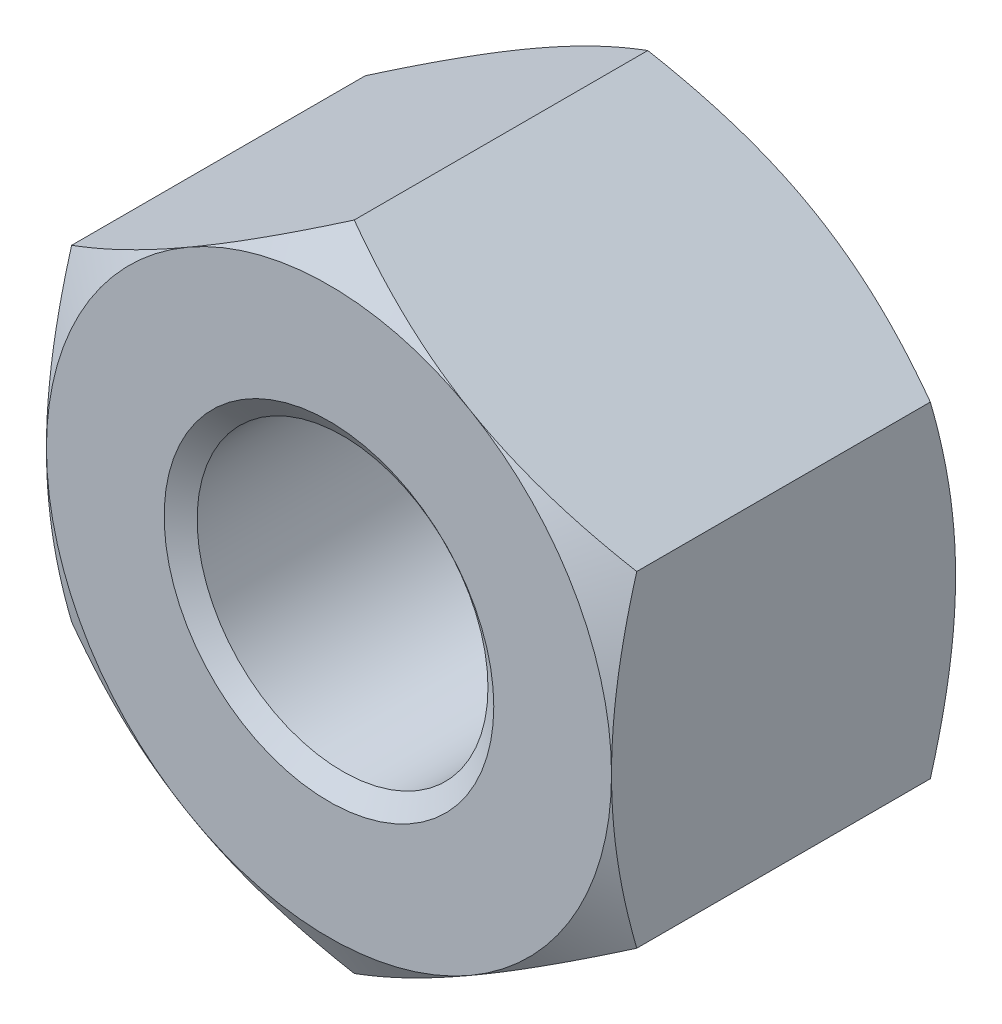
ISO-10303-21;
HEADER;
FILE_DESCRIPTION(('STEP AP214'),'2;1');
FILE_NAME('part.step','',(''),(''),'','','');
FILE_SCHEMA(('AUTOMOTIVE_DESIGN { 1 0 10303 214 1 1 1 1 }'));
ENDSEC;
DATA;
#1=APPLICATION_CONTEXT('core data for automotive mechanical design processes');
#2=APPLICATION_PROTOCOL_DEFINITION('international standard','automotive_design',2000,#1);
#3=PRODUCT_CONTEXT('',#1,'mechanical');
#4=PRODUCT('Part','Part','',(#3));
#5=PRODUCT_RELATED_PRODUCT_CATEGORY('part','',(#4));
#6=PRODUCT_DEFINITION_FORMATION('','',#4);
#7=PRODUCT_DEFINITION_CONTEXT('part definition',#1,'design');
#8=PRODUCT_DEFINITION('design','',#6,#7);
#9=PRODUCT_DEFINITION_SHAPE('','',#8);
#10=(LENGTH_UNIT() NAMED_UNIT(*) SI_UNIT(.MILLI.,.METRE.));
#11=(NAMED_UNIT(*) PLANE_ANGLE_UNIT() SI_UNIT($,.RADIAN.));
#12=(NAMED_UNIT(*) SI_UNIT($,.STERADIAN.) SOLID_ANGLE_UNIT());
#13=UNCERTAINTY_MEASURE_WITH_UNIT(LENGTH_MEASURE(1.E-05),#10,'distance_accuracy_value','');
#14=(GEOMETRIC_REPRESENTATION_CONTEXT(3) GLOBAL_UNCERTAINTY_ASSIGNED_CONTEXT((#13)) GLOBAL_UNIT_ASSIGNED_CONTEXT((#10,
#11,#12)) REPRESENTATION_CONTEXT('',''));
#15=CARTESIAN_POINT('',(0.,0.,0.));
#16=DIRECTION('',(0.,0.,1.));
#17=DIRECTION('',(1.,0.,0.));
#18=AXIS2_PLACEMENT_3D('',#15,#16,#17);
#19=CARTESIAN_POINT('',(0.,19.6299091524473,-20.7));
#20=DIRECTION('',(-0.500000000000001,0.866025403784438,0.));
#21=DIRECTION('',(-0.866025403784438,-0.500000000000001,0.));
#22=AXIS2_PLACEMENT_3D('',#19,#20,#21);
#23=PLANE('',#22);
#24=DIRECTION('',(0.,0.,1.));
#25=VECTOR('',#24,1.);
#26=CARTESIAN_POINT('',(-17.,9.81495457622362,-20.7));
#27=LINE('',#26,#25);
#28=CARTESIAN_POINT('',(-17.,9.81495457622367,-19.1816212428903));
#29=VERTEX_POINT('',#28);
#30=CARTESIAN_POINT('',(-17.,9.81495457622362,-1.51837875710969));
#31=VERTEX_POINT('',#30);
#32=EDGE_CURVE('E160',#29,#31,#27,.T.);
#33=ORIENTED_EDGE('',*,*,#32,.T.);
#34=CARTESIAN_POINT('',(-17.0002,9.81483910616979,-1.51844542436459));
#35=CARTESIAN_POINT('',(-16.6265469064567,10.0305678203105,-1.39390284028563));
#36=CARTESIAN_POINT('',(-16.251436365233,10.2471379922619,-1.27501178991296));
#37=CARTESIAN_POINT('',(-15.4982073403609,10.6820149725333,-1.05010368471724));
#38=CARTESIAN_POINT('',(-15.1200879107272,10.9003223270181,-0.944090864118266));
#39=CARTESIAN_POINT('',(-14.3601103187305,11.3390955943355,-0.746364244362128));
#40=CARTESIAN_POINT('',(-13.9782455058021,11.5595653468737,-0.654684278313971));
#41=CARTESIAN_POINT('',(-13.2118624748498,12.0020367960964,-0.487592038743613));
#42=CARTESIAN_POINT('',(-12.8273444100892,12.2240384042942,-0.412178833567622));
#43=CARTESIAN_POINT('',(-12.0655075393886,12.6638851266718,-0.280827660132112));
#44=CARTESIAN_POINT('',(-11.6882452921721,12.8816975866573,-0.224454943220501));
#45=CARTESIAN_POINT('',(-10.9319921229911,13.3183205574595,-0.129930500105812));
#46=CARTESIAN_POINT('',(-10.5530011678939,13.5371310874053,-0.0917791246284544));
#47=CARTESIAN_POINT('',(-9.79438261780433,13.9751197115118,-0.0346606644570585));
#48=CARTESIAN_POINT('',(-9.41475631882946,14.1942970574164,-0.0156707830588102));
#49=CARTESIAN_POINT('',(-8.65515330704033,14.6328540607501,0.00271629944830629));
#50=CARTESIAN_POINT('',(-8.27517660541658,14.8522337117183,0.00211410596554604));
#51=CARTESIAN_POINT('',(-7.56480067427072,15.2623694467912,-0.0173147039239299));
#52=CARTESIAN_POINT('',(-7.23435083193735,15.4531547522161,-0.0337721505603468));
#53=CARTESIAN_POINT('',(-6.57423939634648,15.8342702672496,-0.0811925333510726));
#54=CARTESIAN_POINT('',(-6.2445777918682,16.0246004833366,-0.112155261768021));
#55=CARTESIAN_POINT('',(-5.58616773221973,16.4047337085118,-0.188048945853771));
#56=CARTESIAN_POINT('',(-5.25742037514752,16.5945360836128,-0.232992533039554));
#57=CARTESIAN_POINT('',(-4.60149064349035,16.9732372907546,-0.336054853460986));
#58=CARTESIAN_POINT('',(-4.27430826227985,17.1621361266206,-0.394173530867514));
#59=CARTESIAN_POINT('',(-3.28110391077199,17.7355629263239,-0.589770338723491));
#60=CARTESIAN_POINT('',(-2.61795816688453,18.1184303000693,-0.74675203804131));
#61=CARTESIAN_POINT('',(-1.30155488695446,18.8784560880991,-1.1030361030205));
#62=CARTESIAN_POINT('',(-0.648280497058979,19.2556242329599,-1.30225479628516));
#63=CARTESIAN_POINT('',(0.000199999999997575,19.6300246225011,-1.51844542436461));
#64=B_SPLINE_CURVE_WITH_KNOTS('',3,(#34,#35,#36,#37,#38,#39,#40,#41,#42,#43,#44,#45,#46,#47,#48,
#49,#50,#51,#52,#53,#54,#55,#56,#57,#58,#59,#60,#61,#62,#63),.UNSPECIFIED.,.F.,.F.,(4,2,2,2,2,2,
2,2,2,2,2,2,2,2,4),(0.,1.34725361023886,2.6949489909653,4.04577911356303,5.3965318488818,
6.7139450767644,8.03138366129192,9.34725301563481,10.6630817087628,11.808581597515,
12.9540650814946,14.1005865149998,15.2471030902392,17.590639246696,19.929575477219),.UNSPECIFIED.);
#65=CARTESIAN_POINT('',(-8.50000000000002,14.7224318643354,0.));
#66=VERTEX_POINT('',#65);
#67=EDGE_CURVE('E56',#31,#66,#64,.T.);
#68=ORIENTED_EDGE('',*,*,#67,.T.);
#69=CARTESIAN_POINT('',(0.,19.6299091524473,-1.51837875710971));
#70=VERTEX_POINT('',#69);
#71=EDGE_CURVE('E204',#66,#70,#64,.T.);
#72=ORIENTED_EDGE('',*,*,#71,.T.);
#73=DIRECTION('',(0.,0.,1.));
#74=VECTOR('',#73,1.);
#75=CARTESIAN_POINT('',(0.,19.6299091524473,-20.7));
#76=LINE('',#75,#74);
#77=CARTESIAN_POINT('',(0.,19.6299091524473,-19.1816212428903));
#78=VERTEX_POINT('',#77);
#79=EDGE_CURVE('E145',#78,#70,#76,.T.);
#80=ORIENTED_EDGE('',*,*,#79,.F.);
#81=CARTESIAN_POINT('',(-17.0002,9.81483910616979,-19.1815545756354));
#82=CARTESIAN_POINT('',(-16.6265469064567,10.0305678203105,-19.3060971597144));
#83=CARTESIAN_POINT('',(-16.251436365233,10.2471379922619,-19.424988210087));
#84=CARTESIAN_POINT('',(-15.4982073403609,10.6820149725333,-19.6498963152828));
#85=CARTESIAN_POINT('',(-15.1200879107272,10.9003223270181,-19.7559091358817));
#86=CARTESIAN_POINT('',(-14.3601103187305,11.3390955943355,-19.9536357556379));
#87=CARTESIAN_POINT('',(-13.9782455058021,11.5595653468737,-20.045315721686));
#88=CARTESIAN_POINT('',(-13.2118624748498,12.0020367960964,-20.2124079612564));
#89=CARTESIAN_POINT('',(-12.8273444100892,12.2240384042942,-20.2878211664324));
#90=CARTESIAN_POINT('',(-12.0655075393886,12.6638851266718,-20.4191723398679));
#91=CARTESIAN_POINT('',(-11.6882452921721,12.8816975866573,-20.4755450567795));
#92=CARTESIAN_POINT('',(-10.9319921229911,13.3183205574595,-20.5700694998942));
#93=CARTESIAN_POINT('',(-10.5530011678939,13.5371310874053,-20.6082208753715));
#94=CARTESIAN_POINT('',(-9.79438261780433,13.9751197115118,-20.6653393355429));
#95=CARTESIAN_POINT('',(-9.41475631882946,14.1942970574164,-20.6843292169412));
#96=CARTESIAN_POINT('',(-8.65515330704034,14.6328540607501,-20.7027162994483));
#97=CARTESIAN_POINT('',(-8.27517660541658,14.8522337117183,-20.7021141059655));
#98=CARTESIAN_POINT('',(-7.56480067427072,15.2623694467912,-20.6826852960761));
#99=CARTESIAN_POINT('',(-7.23435083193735,15.4531547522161,-20.6662278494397));
#100=CARTESIAN_POINT('',(-6.57423939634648,15.8342702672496,-20.6188074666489));
#101=CARTESIAN_POINT('',(-6.2445777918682,16.0246004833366,-20.587844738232));
#102=CARTESIAN_POINT('',(-5.58616773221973,16.4047337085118,-20.5119510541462));
#103=CARTESIAN_POINT('',(-5.25742037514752,16.5945360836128,-20.4670074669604));
#104=CARTESIAN_POINT('',(-4.60149064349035,16.9732372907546,-20.363945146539));
#105=CARTESIAN_POINT('',(-4.27430826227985,17.1621361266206,-20.3058264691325));
#106=CARTESIAN_POINT('',(-3.28110391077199,17.7355629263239,-20.1102296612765));
#107=CARTESIAN_POINT('',(-2.61795816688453,18.1184303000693,-19.9532479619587));
#108=CARTESIAN_POINT('',(-1.30155488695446,18.8784560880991,-19.5969638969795));
#109=CARTESIAN_POINT('',(-0.648280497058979,19.2556242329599,-19.3977452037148));
#110=CARTESIAN_POINT('',(0.000199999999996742,19.6300246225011,-19.1815545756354));
#111=B_SPLINE_CURVE_WITH_KNOTS('',3,(#81,#82,#83,#84,#85,#86,#87,#88,#89,#90,#91,#92,#93,#94,
#95,#96,#97,#98,#99,#100,#101,#102,#103,#104,#105,#106,#107,#108,#109,#110),.UNSPECIFIED.,.F.,
.F.,(4,2,2,2,2,2,2,2,2,2,2,2,2,2,4),(0.,1.34725361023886,2.6949489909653,4.04577911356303,
5.3965318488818,6.7139450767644,8.03138366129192,9.3472530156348,10.6630817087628,
11.808581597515,12.9540650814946,14.1005865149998,15.2471030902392,17.590639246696,
19.929575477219),.UNSPECIFIED.);
#112=CARTESIAN_POINT('',(-8.50000000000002,14.7224318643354,-20.7));
#113=VERTEX_POINT('',#112);
#114=EDGE_CURVE('E163',#113,#78,#111,.T.);
#115=ORIENTED_EDGE('',*,*,#114,.F.);
#116=EDGE_CURVE('E210',#29,#113,#111,.T.);
#117=ORIENTED_EDGE('',*,*,#116,.F.);
#118=EDGE_LOOP('',(#33,#68,#72,#80,#115,#117));
#119=FACE_BOUND('',#118,.T.);
#120=ADVANCED_FACE('F33',(#119),#23,.T.);
#121=CARTESIAN_POINT('',(17.,9.81495457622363,-20.7));
#122=DIRECTION('',(0.500000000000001,0.866025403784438,0.));
#123=DIRECTION('',(-0.866025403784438,0.500000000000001,0.));
#124=AXIS2_PLACEMENT_3D('',#121,#122,#123);
#125=PLANE('',#124);
#126=ORIENTED_EDGE('',*,*,#79,.T.);
#127=CARTESIAN_POINT('',(-0.00020000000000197,19.6300246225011,-1.51844542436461));
#128=CARTESIAN_POINT('',(0.373453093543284,19.4142959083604,-1.39390284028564));
#129=CARTESIAN_POINT('',(0.748563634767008,19.197725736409,-1.27501178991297));
#130=CARTESIAN_POINT('',(1.50179265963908,18.7628487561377,-1.05010368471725));
#131=CARTESIAN_POINT('',(1.87991208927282,18.5445414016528,-0.944090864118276));
#132=CARTESIAN_POINT('',(2.63988968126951,18.1057681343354,-0.746364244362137));
#133=CARTESIAN_POINT('',(3.02175449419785,17.8852983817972,-0.654684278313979));
#134=CARTESIAN_POINT('',(3.78813752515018,17.4428269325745,-0.48759203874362));
#135=CARTESIAN_POINT('',(4.1726555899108,17.2208253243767,-0.412178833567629));
#136=CARTESIAN_POINT('',(4.93449246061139,16.7809786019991,-0.280827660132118));
#137=CARTESIAN_POINT('',(5.31175470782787,16.5631661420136,-0.224454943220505));
#138=CARTESIAN_POINT('',(6.06800787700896,16.1265431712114,-0.129930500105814));
#139=CARTESIAN_POINT('',(6.44699883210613,15.9077326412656,-0.0917791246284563));
#140=CARTESIAN_POINT('',(7.20561738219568,15.4697440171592,-0.0346606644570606));
#141=CARTESIAN_POINT('',(7.58524368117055,15.2505666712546,-0.0156707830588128));
#142=CARTESIAN_POINT('',(8.34484669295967,14.8120096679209,0.00271629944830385));
#143=CARTESIAN_POINT('',(8.72482339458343,14.5926300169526,0.00211410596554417));
#144=CARTESIAN_POINT('',(9.43519932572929,14.1824942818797,-0.0173147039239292));
#145=CARTESIAN_POINT('',(9.76564916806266,13.9917089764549,-0.0337721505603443));
#146=CARTESIAN_POINT('',(10.4257606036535,13.6105934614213,-0.08119253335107));
#147=CARTESIAN_POINT('',(10.7554222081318,13.4202632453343,-0.11215526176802));
#148=CARTESIAN_POINT('',(11.4138322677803,13.0401300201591,-0.18804894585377));
#149=CARTESIAN_POINT('',(11.7425796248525,12.8503276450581,-0.232992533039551));
#150=CARTESIAN_POINT('',(12.3985093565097,12.4716264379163,-0.33605485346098));
#151=CARTESIAN_POINT('',(12.7256917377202,12.2827276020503,-0.394173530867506));
#152=CARTESIAN_POINT('',(13.718896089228,11.709300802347,-0.589770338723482));
#153=CARTESIAN_POINT('',(14.3820418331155,11.3264334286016,-0.746752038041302));
#154=CARTESIAN_POINT('',(15.6984451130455,10.5664076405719,-1.10303610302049));
#155=CARTESIAN_POINT('',(16.351719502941,10.189239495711,-1.30225479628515));
#156=CARTESIAN_POINT('',(17.0002,9.81483910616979,-1.5184454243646));
#157=B_SPLINE_CURVE_WITH_KNOTS('',3,(#127,#128,#129,#130,#131,#132,#133,#134,#135,#136,#137,
#138,#139,#140,#141,#142,#143,#144,#145,#146,#147,#148,#149,#150,#151,#152,#153,#154,#155,#156),
.UNSPECIFIED.,.F.,.F.,(4,2,2,2,2,2,2,2,2,2,2,2,2,2,4),(0.,1.34725361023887,2.69494899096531,
4.04577911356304,5.39653184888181,6.71394507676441,8.03138366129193,9.34725301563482,
10.6630817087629,11.808581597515,12.9540650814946,14.1005865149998,15.2471030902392,
17.590639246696,19.9295754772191),.UNSPECIFIED.);
#158=CARTESIAN_POINT('',(8.50000000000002,14.7224318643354,0.));
#159=VERTEX_POINT('',#158);
#160=EDGE_CURVE('E138',#70,#159,#157,.T.);
#161=ORIENTED_EDGE('',*,*,#160,.T.);
#162=CARTESIAN_POINT('',(17.,9.81495457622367,-1.51837875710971));
#163=VERTEX_POINT('',#162);
#164=EDGE_CURVE('E124',#159,#163,#157,.T.);
#165=ORIENTED_EDGE('',*,*,#164,.T.);
#166=DIRECTION('',(0.,0.,1.));
#167=VECTOR('',#166,1.);
#168=CARTESIAN_POINT('',(17.,9.81495457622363,-20.7));
#169=LINE('',#168,#167);
#170=CARTESIAN_POINT('',(17.,9.81495457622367,-19.1816212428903));
#171=VERTEX_POINT('',#170);
#172=EDGE_CURVE('E137',#171,#163,#169,.T.);
#173=ORIENTED_EDGE('',*,*,#172,.F.);
#174=CARTESIAN_POINT('',(-0.00020000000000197,19.6300246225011,-19.1815545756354));
#175=CARTESIAN_POINT('',(0.373453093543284,19.4142959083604,-19.3060971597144));
#176=CARTESIAN_POINT('',(0.748563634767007,19.197725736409,-19.424988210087));
#177=CARTESIAN_POINT('',(1.50179265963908,18.7628487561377,-19.6498963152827));
#178=CARTESIAN_POINT('',(1.87991208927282,18.5445414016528,-19.7559091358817));
#179=CARTESIAN_POINT('',(2.63988968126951,18.1057681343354,-19.9536357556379));
#180=CARTESIAN_POINT('',(3.02175449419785,17.8852983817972,-20.045315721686));
#181=CARTESIAN_POINT('',(3.78813752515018,17.4428269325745,-20.2124079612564));
#182=CARTESIAN_POINT('',(4.1726555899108,17.2208253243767,-20.2878211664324));
#183=CARTESIAN_POINT('',(4.93449246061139,16.7809786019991,-20.4191723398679));
#184=CARTESIAN_POINT('',(5.31175470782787,16.5631661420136,-20.4755450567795));
#185=CARTESIAN_POINT('',(6.06800787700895,16.1265431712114,-20.5700694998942));
#186=CARTESIAN_POINT('',(6.44699883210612,15.9077326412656,-20.6082208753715));
#187=CARTESIAN_POINT('',(7.20561738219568,15.4697440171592,-20.6653393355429));
#188=CARTESIAN_POINT('',(7.58524368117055,15.2505666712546,-20.6843292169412));
#189=CARTESIAN_POINT('',(8.34484669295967,14.8120096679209,-20.7027162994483));
#190=CARTESIAN_POINT('',(8.72482339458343,14.5926300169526,-20.7021141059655));
#191=CARTESIAN_POINT('',(9.43519932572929,14.1824942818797,-20.6826852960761));
#192=CARTESIAN_POINT('',(9.76564916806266,13.9917089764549,-20.6662278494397));
#193=CARTESIAN_POINT('',(10.4257606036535,13.6105934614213,-20.6188074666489));
#194=CARTESIAN_POINT('',(10.7554222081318,13.4202632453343,-20.587844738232));
#195=CARTESIAN_POINT('',(11.4138322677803,13.0401300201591,-20.5119510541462));
#196=CARTESIAN_POINT('',(11.7425796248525,12.8503276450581,-20.4670074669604));
#197=CARTESIAN_POINT('',(12.3985093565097,12.4716264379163,-20.363945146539));
#198=CARTESIAN_POINT('',(12.7256917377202,12.2827276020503,-20.3058264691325));
#199=CARTESIAN_POINT('',(13.718896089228,11.709300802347,-20.1102296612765));
#200=CARTESIAN_POINT('',(14.3820418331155,11.3264334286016,-19.9532479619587));
#201=CARTESIAN_POINT('',(15.6984451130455,10.5664076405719,-19.5969638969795));
#202=CARTESIAN_POINT('',(16.351719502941,10.189239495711,-19.3977452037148));
#203=CARTESIAN_POINT('',(17.0002,9.81483910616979,-19.1815545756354));
#204=B_SPLINE_CURVE_WITH_KNOTS('',3,(#174,#175,#176,#177,#178,#179,#180,#181,#182,#183,#184,
#185,#186,#187,#188,#189,#190,#191,#192,#193,#194,#195,#196,#197,#198,#199,#200,#201,#202,#203),
.UNSPECIFIED.,.F.,.F.,(4,2,2,2,2,2,2,2,2,2,2,2,2,2,4),(0.,1.34725361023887,2.69494899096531,
4.04577911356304,5.39653184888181,6.71394507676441,8.03138366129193,9.34725301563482,
10.6630817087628,11.808581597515,12.9540650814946,14.1005865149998,15.2471030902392,
17.590639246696,19.9295754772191),.UNSPECIFIED.);
#205=CARTESIAN_POINT('',(8.50000000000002,14.7224318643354,-20.7));
#206=VERTEX_POINT('',#205);
#207=EDGE_CURVE('E221',#206,#171,#204,.T.);
#208=ORIENTED_EDGE('',*,*,#207,.F.);
#209=EDGE_CURVE('E222',#78,#206,#204,.T.);
#210=ORIENTED_EDGE('',*,*,#209,.F.);
#211=EDGE_LOOP('',(#126,#161,#165,#173,#208,#210));
#212=FACE_BOUND('',#211,.T.);
#213=ADVANCED_FACE('F135',(#212),#125,.T.);
#214=CARTESIAN_POINT('',(17.,9.81495457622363,-20.7));
#215=DIRECTION('',(-1.,0.,0.));
#216=DIRECTION('',(0.,0.,1.));
#217=AXIS2_PLACEMENT_3D('',#214,#215,#216);
#218=PLANE('',#217);
#219=CARTESIAN_POINT('',(17.,-26.0307059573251,-8.13495399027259));
#220=CARTESIAN_POINT('',(17.,-25.6575217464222,-7.95456227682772));
#221=CARTESIAN_POINT('',(17.,-25.2838864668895,-7.7751041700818));
#222=CARTESIAN_POINT('',(17.,-24.5356184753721,-7.41826946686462));
#223=CARTESIAN_POINT('',(17.,-24.1609857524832,-7.24089289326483));
#224=CARTESIAN_POINT('',(17.,-23.0353387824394,-6.71215553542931));
#225=CARTESIAN_POINT('',(17.,-22.2826970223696,-6.36424591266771));
#226=CARTESIAN_POINT('',(17.,-20.7679056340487,-5.6778850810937));
#227=CARTESIAN_POINT('',(17.,-20.0057262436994,-5.33949939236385));
#228=CARTESIAN_POINT('',(17.,-18.4751037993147,-4.67725670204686));
#229=CARTESIAN_POINT('',(17.,-17.7066610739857,-4.35339894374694));
#230=CARTESIAN_POINT('',(17.,-16.152750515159,-3.72023983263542));
#231=CARTESIAN_POINT('',(17.,-15.3671894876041,-3.41116600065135));
#232=CARTESIAN_POINT('',(17.,-13.7867962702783,-2.81722387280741));
#233=CARTESIAN_POINT('',(17.,-12.9919630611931,-2.53235826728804));
#234=CARTESIAN_POINT('',(17.,-11.3934196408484,-1.99449069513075));
#235=CARTESIAN_POINT('',(17.,-10.589732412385,-1.74142098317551));
#236=CARTESIAN_POINT('',(17.,-8.97085479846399,-1.27535153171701));
#237=CARTESIAN_POINT('',(17.,-8.15566813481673,-1.06233913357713));
#238=CARTESIAN_POINT('',(17.,-6.92410865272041,-0.780661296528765));
#239=CARTESIAN_POINT('',(17.,-6.51203814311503,-0.693061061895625));
#240=CARTESIAN_POINT('',(17.,-5.68515456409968,-0.531857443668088));
#241=CARTESIAN_POINT('',(17.,-5.27034155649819,-0.458253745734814));
#242=CARTESIAN_POINT('',(17.,-4.43825138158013,-0.326348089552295));
#243=CARTESIAN_POINT('',(17.,-4.02097406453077,-0.268047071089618));
#244=CARTESIAN_POINT('',(17.,-3.1844334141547,-0.167917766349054));
#245=CARTESIAN_POINT('',(17.,-2.76517007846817,-0.126089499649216));
#246=CARTESIAN_POINT('',(17.,-1.9279303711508,-0.0600317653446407));
#247=CARTESIAN_POINT('',(17.,-1.509962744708,-0.0356921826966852));
#248=CARTESIAN_POINT('',(17.,-0.673373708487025,-0.00473977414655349));
#249=CARTESIAN_POINT('',(17.,-0.254752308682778,0.00187331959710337));
#250=CARTESIAN_POINT('',(17.,0.582277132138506,-0.00278408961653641));
#251=CARTESIAN_POINT('',(17.,1.00068520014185,-0.0140496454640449));
#252=CARTESIAN_POINT('',(17.,1.83665802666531,-0.0541842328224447));
#253=CARTESIAN_POINT('',(17.,2.25422274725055,-0.083054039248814));
#254=CARTESIAN_POINT('',(17.,3.26596548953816,-0.173730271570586));
#255=CARTESIAN_POINT('',(17.,3.8593699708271,-0.244339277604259));
#256=CARTESIAN_POINT('',(17.,5.04153028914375,-0.417178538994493));
#257=CARTESIAN_POINT('',(17.,5.6302854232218,-0.51941348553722));
#258=CARTESIAN_POINT('',(17.,7.39060393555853,-0.868429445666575));
#259=CARTESIAN_POINT('',(17.,8.55392089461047,-1.15728923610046));
#260=CARTESIAN_POINT('',(17.,10.2940487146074,-1.65537919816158));
#261=CARTESIAN_POINT('',(17.,10.8799513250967,-1.83464660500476));
#262=CARTESIAN_POINT('',(17.,12.0460961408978,-2.2110551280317));
#263=CARTESIAN_POINT('',(17.,12.6263378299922,-2.40819785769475));
#264=CARTESIAN_POINT('',(17.,13.7782685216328,-2.81615640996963));
#265=CARTESIAN_POINT('',(17.,14.3499873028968,-3.026888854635));
#266=CARTESIAN_POINT('',(17.,15.2039647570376,-3.35211134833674));
#267=CARTESIAN_POINT('',(17.,15.4879778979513,-3.46202087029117));
#268=CARTESIAN_POINT('',(17.,16.0549008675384,-3.68463436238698));
#269=CARTESIAN_POINT('',(17.,16.3378107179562,-3.79733827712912));
#270=CARTESIAN_POINT('',(17.,16.6202072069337,-3.91131327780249));
#271=B_SPLINE_CURVE_WITH_KNOTS('',3,(#219,#220,#221,#222,#223,#224,#225,#226,#227,#228,#229,
#230,#231,#232,#233,#234,#235,#236,#237,#238,#239,#240,#241,#242,#243,#244,#245,#246,#247,#248,
#249,#250,#251,#252,#253,#254,#255,#256,#257,#258,#259,#260,#261,#262,#263,#264,#265,#266,#267,
#268,#269,#270),.UNSPECIFIED.,.F.,.F.,(4,2,2,2,2,2,2,2,2,2,2,2,2,2,2,2,2,2,2,2,2,2,2,2,2,4),(0.,
1.24348808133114,2.48698981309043,4.97439762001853,7.47603986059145,9.97755164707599,
12.5097743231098,15.0422780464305,17.5692909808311,20.0955039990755,21.359141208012,
22.6227500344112,23.8864364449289,25.1501243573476,26.4057842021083,27.6614250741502,
28.9167185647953,30.172067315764,31.9638212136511,33.7558410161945,37.3467834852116,
39.184781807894,41.0229461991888,42.8507444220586,43.7643464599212,44.6779303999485),.UNSPECIFIED.);
#272=CARTESIAN_POINT('',(17.,-9.81495457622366,-1.51837875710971));
#273=VERTEX_POINT('',#272);
#274=CARTESIAN_POINT('',(17.,0.,0.));
#275=VERTEX_POINT('',#274);
#276=EDGE_CURVE('E130',#273,#275,#271,.T.);
#277=ORIENTED_EDGE('',*,*,#276,.F.);
#278=DIRECTION('',(0.,0.,1.));
#279=VECTOR('',#278,1.);
#280=CARTESIAN_POINT('',(17.,-9.81495457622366,-20.7));
#281=LINE('',#280,#279);
#282=CARTESIAN_POINT('',(17.,-9.81495457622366,-19.1816212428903));
#283=VERTEX_POINT('',#282);
#284=EDGE_CURVE('E146',#283,#273,#281,.T.);
#285=ORIENTED_EDGE('',*,*,#284,.F.);
#286=CARTESIAN_POINT('',(17.,-26.0307059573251,-12.5650460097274));
#287=CARTESIAN_POINT('',(17.,-25.6575217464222,-12.7454377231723));
#288=CARTESIAN_POINT('',(17.,-25.2838864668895,-12.9248958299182));
#289=CARTESIAN_POINT('',(17.,-24.5356184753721,-13.2817305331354));
#290=CARTESIAN_POINT('',(17.,-24.1609857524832,-13.4591071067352));
#291=CARTESIAN_POINT('',(17.,-23.0353387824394,-13.9878444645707));
#292=CARTESIAN_POINT('',(17.,-22.2826970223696,-14.3357540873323));
#293=CARTESIAN_POINT('',(17.,-20.7679056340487,-15.0221149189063));
#294=CARTESIAN_POINT('',(17.,-20.0057262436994,-15.3605006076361));
#295=CARTESIAN_POINT('',(17.,-18.4751037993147,-16.0227432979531));
#296=CARTESIAN_POINT('',(17.,-17.7066610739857,-16.3466010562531));
#297=CARTESIAN_POINT('',(17.,-16.152750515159,-16.9797601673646));
#298=CARTESIAN_POINT('',(17.,-15.3671894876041,-17.2888339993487));
#299=CARTESIAN_POINT('',(17.,-13.7867962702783,-17.8827761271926));
#300=CARTESIAN_POINT('',(17.,-12.9919630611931,-18.167641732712));
#301=CARTESIAN_POINT('',(17.,-11.3934196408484,-18.7055093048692));
#302=CARTESIAN_POINT('',(17.,-10.589732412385,-18.9585790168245));
#303=CARTESIAN_POINT('',(17.,-8.97085479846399,-19.424648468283));
#304=CARTESIAN_POINT('',(17.,-8.15566813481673,-19.6376608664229));
#305=CARTESIAN_POINT('',(17.,-6.92410865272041,-19.9193387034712));
#306=CARTESIAN_POINT('',(17.,-6.51203814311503,-20.0069389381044));
#307=CARTESIAN_POINT('',(17.,-5.68515456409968,-20.1681425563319));
#308=CARTESIAN_POINT('',(17.,-5.27034155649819,-20.2417462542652));
#309=CARTESIAN_POINT('',(17.,-4.43825138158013,-20.3736519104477));
#310=CARTESIAN_POINT('',(17.,-4.02097406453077,-20.4319529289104));
#311=CARTESIAN_POINT('',(17.,-3.1844334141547,-20.5320822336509));
#312=CARTESIAN_POINT('',(17.,-2.76517007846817,-20.5739105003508));
#313=CARTESIAN_POINT('',(17.,-1.9279303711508,-20.6399682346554));
#314=CARTESIAN_POINT('',(17.,-1.509962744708,-20.6643078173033));
#315=CARTESIAN_POINT('',(17.,-0.673373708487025,-20.6952602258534));
#316=CARTESIAN_POINT('',(17.,-0.254752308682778,-20.7018733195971));
#317=CARTESIAN_POINT('',(17.,0.582277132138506,-20.6972159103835));
#318=CARTESIAN_POINT('',(17.,1.00068520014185,-20.685950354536));
#319=CARTESIAN_POINT('',(17.,1.83665802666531,-20.6458157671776));
#320=CARTESIAN_POINT('',(17.,2.25422274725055,-20.6169459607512));
#321=CARTESIAN_POINT('',(17.,3.26596548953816,-20.5262697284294));
#322=CARTESIAN_POINT('',(17.,3.85936997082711,-20.4556607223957));
#323=CARTESIAN_POINT('',(17.,5.04153028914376,-20.2828214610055));
#324=CARTESIAN_POINT('',(17.,5.63028542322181,-20.1805865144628));
#325=CARTESIAN_POINT('',(17.,7.39060393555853,-19.8315705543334));
#326=CARTESIAN_POINT('',(17.,8.55392089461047,-19.5427107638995));
#327=CARTESIAN_POINT('',(17.,10.2940487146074,-19.0446208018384));
#328=CARTESIAN_POINT('',(17.,10.8799513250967,-18.8653533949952));
#329=CARTESIAN_POINT('',(17.,12.0460961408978,-18.4889448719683));
#330=CARTESIAN_POINT('',(17.,12.6263378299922,-18.2918021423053));
#331=CARTESIAN_POINT('',(17.,13.7782685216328,-17.8838435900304));
#332=CARTESIAN_POINT('',(17.,14.3499873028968,-17.673111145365));
#333=CARTESIAN_POINT('',(17.,15.2039647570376,-17.3478886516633));
#334=CARTESIAN_POINT('',(17.,15.4879778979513,-17.2379791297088));
#335=CARTESIAN_POINT('',(17.,16.0549008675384,-17.015365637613));
#336=CARTESIAN_POINT('',(17.,16.3378107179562,-16.9026617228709));
#337=CARTESIAN_POINT('',(17.,16.6202072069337,-16.7886867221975));
#338=B_SPLINE_CURVE_WITH_KNOTS('',3,(#286,#287,#288,#289,#290,#291,#292,#293,#294,#295,#296,
#297,#298,#299,#300,#301,#302,#303,#304,#305,#306,#307,#308,#309,#310,#311,#312,#313,#314,#315,
#316,#317,#318,#319,#320,#321,#322,#323,#324,#325,#326,#327,#328,#329,#330,#331,#332,#333,#334,
#335,#336,#337),.UNSPECIFIED.,.F.,.F.,(4,2,2,2,2,2,2,2,2,2,2,2,2,2,2,2,2,2,2,2,2,2,2,2,2,4),(0.,
1.24348808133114,2.48698981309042,4.97439762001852,7.47603986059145,9.97755164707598,
12.5097743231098,15.0422780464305,17.5692909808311,20.0955039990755,21.359141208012,
22.6227500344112,23.8864364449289,25.1501243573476,26.4057842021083,27.6614250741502,
28.9167185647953,30.172067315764,31.9638212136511,33.7558410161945,37.3467834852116,
39.184781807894,41.0229461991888,42.8507444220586,43.7643464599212,44.6779303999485),.UNSPECIFIED.);
#339=CARTESIAN_POINT('',(17.,0.,-20.7));
#340=VERTEX_POINT('',#339);
#341=EDGE_CURVE('E207',#283,#340,#338,.T.);
#342=ORIENTED_EDGE('',*,*,#341,.T.);
#343=EDGE_CURVE('E144',#340,#171,#338,.T.);
#344=ORIENTED_EDGE('',*,*,#343,.T.);
#345=ORIENTED_EDGE('',*,*,#172,.T.);
#346=EDGE_CURVE('E121',#275,#163,#271,.T.);
#347=ORIENTED_EDGE('',*,*,#346,.F.);
#348=EDGE_LOOP('',(#277,#285,#342,#344,#345,#347));
#349=FACE_BOUND('',#348,.T.);
#350=ADVANCED_FACE('F141',(#349),#218,.F.);
#351=CARTESIAN_POINT('',(0.,-19.6299091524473,-20.7));
#352=DIRECTION('',(0.500000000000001,-0.866025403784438,0.));
#353=DIRECTION('',(0.866025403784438,0.500000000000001,0.));
#354=AXIS2_PLACEMENT_3D('',#351,#352,#353);
#355=PLANE('',#354);
#356=ORIENTED_EDGE('',*,*,#284,.T.);
#357=CARTESIAN_POINT('',(17.0002,-9.81483910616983,-1.51844542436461));
#358=CARTESIAN_POINT('',(16.6265469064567,-10.0305678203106,-1.39390284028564));
#359=CARTESIAN_POINT('',(16.251436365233,-10.247137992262,-1.27501178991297));
#360=CARTESIAN_POINT('',(15.4982073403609,-10.6820149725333,-1.05010368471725));
#361=CARTESIAN_POINT('',(15.1200879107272,-10.9003223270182,-0.94409086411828));
#362=CARTESIAN_POINT('',(14.3601103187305,-11.3390955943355,-0.746364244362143));
#363=CARTESIAN_POINT('',(13.9782455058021,-11.5595653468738,-0.654684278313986));
#364=CARTESIAN_POINT('',(13.2118624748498,-12.0020367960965,-0.487592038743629));
#365=CARTESIAN_POINT('',(12.8273444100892,-12.2240384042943,-0.412178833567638));
#366=CARTESIAN_POINT('',(12.0655075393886,-12.6638851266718,-0.280827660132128));
#367=CARTESIAN_POINT('',(11.6882452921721,-12.8816975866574,-0.224454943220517));
#368=CARTESIAN_POINT('',(10.931992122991,-13.3183205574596,-0.12993050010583));
#369=CARTESIAN_POINT('',(10.5530011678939,-13.5371310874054,-0.0917791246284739));
#370=CARTESIAN_POINT('',(9.79438261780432,-13.9751197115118,-0.0346606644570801));
#371=CARTESIAN_POINT('',(9.41475631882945,-14.1942970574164,-0.0156707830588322));
#372=CARTESIAN_POINT('',(8.65515330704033,-14.6328540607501,0.00271629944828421));
#373=CARTESIAN_POINT('',(8.27517660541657,-14.8522337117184,0.00211410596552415));
#374=CARTESIAN_POINT('',(7.56480067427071,-15.2623694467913,-0.017314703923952));
#375=CARTESIAN_POINT('',(7.23435083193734,-15.4531547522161,-0.0337721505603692));
#376=CARTESIAN_POINT('',(6.57423939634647,-15.8342702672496,-0.0811925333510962));
#377=CARTESIAN_POINT('',(6.24457779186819,-16.0246004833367,-0.112155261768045));
#378=CARTESIAN_POINT('',(5.58616773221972,-16.4047337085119,-0.188048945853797));
#379=CARTESIAN_POINT('',(5.25742037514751,-16.5945360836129,-0.232992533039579));
#380=CARTESIAN_POINT('',(4.60149064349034,-16.9732372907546,-0.33605485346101));
#381=CARTESIAN_POINT('',(4.27430826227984,-17.1621361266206,-0.394173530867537));
#382=CARTESIAN_POINT('',(3.28110391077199,-17.735562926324,-0.589770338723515));
#383=CARTESIAN_POINT('',(2.61795816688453,-18.1184303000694,-0.746752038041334));
#384=CARTESIAN_POINT('',(1.30155488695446,-18.8784560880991,-1.10303610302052));
#385=CARTESIAN_POINT('',(0.64828049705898,-19.2556242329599,-1.30225479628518));
#386=CARTESIAN_POINT('',(-0.000199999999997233,-19.6300246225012,-1.51844542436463));
#387=B_SPLINE_CURVE_WITH_KNOTS('',3,(#357,#358,#359,#360,#361,#362,#363,#364,#365,#366,#367,
#368,#369,#370,#371,#372,#373,#374,#375,#376,#377,#378,#379,#380,#381,#382,#383,#384,#385,#386),
.UNSPECIFIED.,.F.,.F.,(4,2,2,2,2,2,2,2,2,2,2,2,2,2,4),(0.,1.34725361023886,2.69494899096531,
4.04577911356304,5.39653184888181,6.71394507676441,8.03138366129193,9.34725301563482,
10.6630817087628,11.808581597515,12.9540650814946,14.1005865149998,15.2471030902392,
17.590639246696,19.9295754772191),.UNSPECIFIED.);
#388=CARTESIAN_POINT('',(8.50000000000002,-14.7224318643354,0.));
#389=VERTEX_POINT('',#388);
#390=EDGE_CURVE('E280',#273,#389,#387,.T.);
#391=ORIENTED_EDGE('',*,*,#390,.T.);
#392=CARTESIAN_POINT('',(0.,-19.6299091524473,-1.51837875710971));
#393=VERTEX_POINT('',#392);
#394=EDGE_CURVE('E274',#389,#393,#387,.T.);
#395=ORIENTED_EDGE('',*,*,#394,.T.);
#396=DIRECTION('',(0.,0.,1.));
#397=VECTOR('',#396,1.);
#398=CARTESIAN_POINT('',(0.,-19.6299091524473,-20.7));
#399=LINE('',#398,#397);
#400=CARTESIAN_POINT('',(0.,-19.6299091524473,-19.1816212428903));
#401=VERTEX_POINT('',#400);
#402=EDGE_CURVE('E151',#401,#393,#399,.T.);
#403=ORIENTED_EDGE('',*,*,#402,.F.);
#404=CARTESIAN_POINT('',(17.0002,-9.81483910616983,-19.1815545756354));
#405=CARTESIAN_POINT('',(16.6265469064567,-10.0305678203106,-19.3060971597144));
#406=CARTESIAN_POINT('',(16.251436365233,-10.247137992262,-19.424988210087));
#407=CARTESIAN_POINT('',(15.4982073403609,-10.6820149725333,-19.6498963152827));
#408=CARTESIAN_POINT('',(15.1200879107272,-10.9003223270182,-19.7559091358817));
#409=CARTESIAN_POINT('',(14.3601103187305,-11.3390955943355,-19.9536357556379));
#410=CARTESIAN_POINT('',(13.9782455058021,-11.5595653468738,-20.045315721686));
#411=CARTESIAN_POINT('',(13.2118624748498,-12.0020367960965,-20.2124079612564));
#412=CARTESIAN_POINT('',(12.8273444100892,-12.2240384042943,-20.2878211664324));
#413=CARTESIAN_POINT('',(12.0655075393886,-12.6638851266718,-20.4191723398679));
#414=CARTESIAN_POINT('',(11.6882452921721,-12.8816975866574,-20.4755450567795));
#415=CARTESIAN_POINT('',(10.931992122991,-13.3183205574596,-20.5700694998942));
#416=CARTESIAN_POINT('',(10.5530011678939,-13.5371310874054,-20.6082208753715));
#417=CARTESIAN_POINT('',(9.79438261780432,-13.9751197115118,-20.6653393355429));
#418=CARTESIAN_POINT('',(9.41475631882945,-14.1942970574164,-20.6843292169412));
#419=CARTESIAN_POINT('',(8.65515330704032,-14.6328540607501,-20.7027162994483));
#420=CARTESIAN_POINT('',(8.27517660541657,-14.8522337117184,-20.7021141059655));
#421=CARTESIAN_POINT('',(7.56480067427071,-15.2623694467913,-20.682685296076));
#422=CARTESIAN_POINT('',(7.23435083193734,-15.4531547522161,-20.6662278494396));
#423=CARTESIAN_POINT('',(6.57423939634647,-15.8342702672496,-20.6188074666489));
#424=CARTESIAN_POINT('',(6.24457779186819,-16.0246004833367,-20.587844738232));
#425=CARTESIAN_POINT('',(5.58616773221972,-16.4047337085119,-20.5119510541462));
#426=CARTESIAN_POINT('',(5.25742037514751,-16.5945360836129,-20.4670074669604));
#427=CARTESIAN_POINT('',(4.60149064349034,-16.9732372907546,-20.363945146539));
#428=CARTESIAN_POINT('',(4.27430826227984,-17.1621361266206,-20.3058264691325));
#429=CARTESIAN_POINT('',(3.28110391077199,-17.735562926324,-20.1102296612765));
#430=CARTESIAN_POINT('',(2.61795816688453,-18.1184303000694,-19.9532479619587));
#431=CARTESIAN_POINT('',(1.30155488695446,-18.8784560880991,-19.5969638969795));
#432=CARTESIAN_POINT('',(0.648280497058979,-19.2556242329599,-19.3977452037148));
#433=CARTESIAN_POINT('',(-0.000199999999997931,-19.6300246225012,-19.1815545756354));
#434=B_SPLINE_CURVE_WITH_KNOTS('',3,(#404,#405,#406,#407,#408,#409,#410,#411,#412,#413,#414,
#415,#416,#417,#418,#419,#420,#421,#422,#423,#424,#425,#426,#427,#428,#429,#430,#431,#432,#433),
.UNSPECIFIED.,.F.,.F.,(4,2,2,2,2,2,2,2,2,2,2,2,2,2,4),(0.,1.34725361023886,2.69494899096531,
4.04577911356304,5.39653184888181,6.71394507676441,8.03138366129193,9.34725301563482,
10.6630817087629,11.808581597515,12.9540650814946,14.1005865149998,15.2471030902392,
17.590639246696,19.9295754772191),.UNSPECIFIED.);
#435=CARTESIAN_POINT('',(8.50000000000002,-14.7224318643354,-20.7));
#436=VERTEX_POINT('',#435);
#437=EDGE_CURVE('E214',#436,#401,#434,.T.);
#438=ORIENTED_EDGE('',*,*,#437,.F.);
#439=EDGE_CURVE('E211',#283,#436,#434,.T.);
#440=ORIENTED_EDGE('',*,*,#439,.F.);
#441=EDGE_LOOP('',(#356,#391,#395,#403,#438,#440));
#442=FACE_BOUND('',#441,.T.);
#443=ADVANCED_FACE('F265',(#442),#355,.T.);
#444=CARTESIAN_POINT('',(-17.,-9.81495457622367,-20.7));
#445=DIRECTION('',(-0.500000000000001,-0.866025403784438,0.));
#446=DIRECTION('',(0.866025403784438,-0.500000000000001,0.));
#447=AXIS2_PLACEMENT_3D('',#444,#445,#446);
#448=PLANE('',#447);
#449=ORIENTED_EDGE('',*,*,#402,.T.);
#450=CARTESIAN_POINT('',(0.000200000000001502,-19.6300246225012,-1.51844542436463));
#451=CARTESIAN_POINT('',(-0.373453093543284,-19.4142959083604,-1.39390284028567));
#452=CARTESIAN_POINT('',(-0.748563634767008,-19.197725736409,-1.275011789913));
#453=CARTESIAN_POINT('',(-1.50179265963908,-18.7628487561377,-1.05010368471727));
#454=CARTESIAN_POINT('',(-1.87991208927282,-18.5445414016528,-0.944090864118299));
#455=CARTESIAN_POINT('',(-2.63988968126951,-18.1057681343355,-0.746364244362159));
#456=CARTESIAN_POINT('',(-3.02175449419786,-17.8852983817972,-0.654684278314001));
#457=CARTESIAN_POINT('',(-3.78813752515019,-17.4428269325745,-0.487592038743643));
#458=CARTESIAN_POINT('',(-4.17265558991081,-17.2208253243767,-0.412178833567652));
#459=CARTESIAN_POINT('',(-4.9344924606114,-16.7809786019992,-0.280827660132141));
#460=CARTESIAN_POINT('',(-5.31175470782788,-16.5631661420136,-0.224454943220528));
#461=CARTESIAN_POINT('',(-6.06800787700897,-16.1265431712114,-0.129930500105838));
#462=CARTESIAN_POINT('',(-6.44699883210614,-15.9077326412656,-0.0917791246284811));
#463=CARTESIAN_POINT('',(-7.20561738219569,-15.4697440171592,-0.034660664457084));
#464=CARTESIAN_POINT('',(-7.58524368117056,-15.2505666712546,-0.0156707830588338));
#465=CARTESIAN_POINT('',(-8.34484669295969,-14.8120096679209,0.00271629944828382));
#466=CARTESIAN_POINT('',(-8.72482339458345,-14.5926300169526,0.00211410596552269));
#467=CARTESIAN_POINT('',(-9.43519932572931,-14.1824942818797,-0.0173147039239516));
#468=CARTESIAN_POINT('',(-9.76564916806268,-13.9917089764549,-0.0337721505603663));
#469=CARTESIAN_POINT('',(-10.4257606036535,-13.6105934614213,-0.0811925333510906));
#470=CARTESIAN_POINT('',(-10.7554222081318,-13.4202632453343,-0.112155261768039));
#471=CARTESIAN_POINT('',(-11.4138322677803,-13.0401300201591,-0.188048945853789));
#472=CARTESIAN_POINT('',(-11.7425796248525,-12.8503276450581,-0.23299253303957));
#473=CARTESIAN_POINT('',(-12.3985093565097,-12.4716264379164,-0.336054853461));
#474=CARTESIAN_POINT('',(-12.7256917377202,-12.2827276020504,-0.394173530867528));
#475=CARTESIAN_POINT('',(-13.718896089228,-11.709300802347,-0.589770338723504));
#476=CARTESIAN_POINT('',(-14.3820418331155,-11.3264334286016,-0.746752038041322));
#477=CARTESIAN_POINT('',(-15.6984451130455,-10.5664076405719,-1.1030361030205));
#478=CARTESIAN_POINT('',(-16.351719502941,-10.1892394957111,-1.30225479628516));
#479=CARTESIAN_POINT('',(-17.0002,-9.81483910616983,-1.51844542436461));
#480=B_SPLINE_CURVE_WITH_KNOTS('',3,(#450,#451,#452,#453,#454,#455,#456,#457,#458,#459,#460,
#461,#462,#463,#464,#465,#466,#467,#468,#469,#470,#471,#472,#473,#474,#475,#476,#477,#478,#479),
.UNSPECIFIED.,.F.,.F.,(4,2,2,2,2,2,2,2,2,2,2,2,2,2,4),(0.,1.34725361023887,2.69494899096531,
4.04577911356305,5.39653184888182,6.71394507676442,8.03138366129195,9.34725301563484,
10.6630817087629,11.8085815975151,12.9540650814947,14.1005865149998,15.2471030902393,
17.590639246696,19.929575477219),.UNSPECIFIED.);
#481=CARTESIAN_POINT('',(-8.50000000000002,-14.7224318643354,0.));
#482=VERTEX_POINT('',#481);
#483=EDGE_CURVE('E281',#393,#482,#480,.T.);
#484=ORIENTED_EDGE('',*,*,#483,.T.);
#485=CARTESIAN_POINT('',(-17.,-9.81495457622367,-1.51837875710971));
#486=VERTEX_POINT('',#485);
#487=EDGE_CURVE('E282',#482,#486,#480,.T.);
#488=ORIENTED_EDGE('',*,*,#487,.T.);
#489=DIRECTION('',(0.,0.,1.));
#490=VECTOR('',#489,1.);
#491=CARTESIAN_POINT('',(-17.,-9.81495457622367,-20.7));
#492=LINE('',#491,#490);
#493=CARTESIAN_POINT('',(-17.,-9.81495457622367,-19.1816212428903));
#494=VERTEX_POINT('',#493);
#495=EDGE_CURVE('E157',#494,#486,#492,.T.);
#496=ORIENTED_EDGE('',*,*,#495,.F.);
#497=CARTESIAN_POINT('',(0.000200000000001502,-19.6300246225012,-19.1815545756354));
#498=CARTESIAN_POINT('',(-0.373453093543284,-19.4142959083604,-19.3060971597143));
#499=CARTESIAN_POINT('',(-0.748563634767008,-19.197725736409,-19.424988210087));
#500=CARTESIAN_POINT('',(-1.50179265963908,-18.7628487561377,-19.6498963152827));
#501=CARTESIAN_POINT('',(-1.87991208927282,-18.5445414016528,-19.7559091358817));
#502=CARTESIAN_POINT('',(-2.63988968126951,-18.1057681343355,-19.9536357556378));
#503=CARTESIAN_POINT('',(-3.02175449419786,-17.8852983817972,-20.045315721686));
#504=CARTESIAN_POINT('',(-3.78813752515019,-17.4428269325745,-20.2124079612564));
#505=CARTESIAN_POINT('',(-4.17265558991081,-17.2208253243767,-20.2878211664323));
#506=CARTESIAN_POINT('',(-4.9344924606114,-16.7809786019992,-20.4191723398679));
#507=CARTESIAN_POINT('',(-5.31175470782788,-16.5631661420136,-20.4755450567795));
#508=CARTESIAN_POINT('',(-6.06800787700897,-16.1265431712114,-20.5700694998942));
#509=CARTESIAN_POINT('',(-6.44699883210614,-15.9077326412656,-20.6082208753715));
#510=CARTESIAN_POINT('',(-7.20561738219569,-15.4697440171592,-20.6653393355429));
#511=CARTESIAN_POINT('',(-7.58524368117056,-15.2505666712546,-20.6843292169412));
#512=CARTESIAN_POINT('',(-8.34484669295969,-14.8120096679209,-20.7027162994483));
#513=CARTESIAN_POINT('',(-8.72482339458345,-14.5926300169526,-20.7021141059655));
#514=CARTESIAN_POINT('',(-9.43519932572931,-14.1824942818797,-20.682685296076));
#515=CARTESIAN_POINT('',(-9.76564916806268,-13.9917089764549,-20.6662278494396));
#516=CARTESIAN_POINT('',(-10.4257606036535,-13.6105934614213,-20.6188074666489));
#517=CARTESIAN_POINT('',(-10.7554222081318,-13.4202632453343,-20.587844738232));
#518=CARTESIAN_POINT('',(-11.4138322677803,-13.0401300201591,-20.5119510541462));
#519=CARTESIAN_POINT('',(-11.7425796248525,-12.8503276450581,-20.4670074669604));
#520=CARTESIAN_POINT('',(-12.3985093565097,-12.4716264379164,-20.363945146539));
#521=CARTESIAN_POINT('',(-12.7256917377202,-12.2827276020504,-20.3058264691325));
#522=CARTESIAN_POINT('',(-13.718896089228,-11.709300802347,-20.1102296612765));
#523=CARTESIAN_POINT('',(-14.3820418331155,-11.3264334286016,-19.9532479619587));
#524=CARTESIAN_POINT('',(-15.6984451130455,-10.5664076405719,-19.5969638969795));
#525=CARTESIAN_POINT('',(-16.351719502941,-10.1892394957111,-19.3977452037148));
#526=CARTESIAN_POINT('',(-17.0002,-9.81483910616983,-19.1815545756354));
#527=B_SPLINE_CURVE_WITH_KNOTS('',3,(#497,#498,#499,#500,#501,#502,#503,#504,#505,#506,#507,
#508,#509,#510,#511,#512,#513,#514,#515,#516,#517,#518,#519,#520,#521,#522,#523,#524,#525,#526),
.UNSPECIFIED.,.F.,.F.,(4,2,2,2,2,2,2,2,2,2,2,2,2,2,4),(0.,1.34725361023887,2.69494899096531,
4.04577911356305,5.39653184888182,6.71394507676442,8.03138366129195,9.34725301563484,
10.6630817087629,11.8085815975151,12.9540650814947,14.1005865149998,15.2471030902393,
17.590639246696,19.9295754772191),.UNSPECIFIED.);
#528=CARTESIAN_POINT('',(-8.50000000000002,-14.7224318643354,-20.7));
#529=VERTEX_POINT('',#528);
#530=EDGE_CURVE('E254',#529,#494,#527,.T.);
#531=ORIENTED_EDGE('',*,*,#530,.F.);
#532=EDGE_CURVE('E264',#401,#529,#527,.T.);
#533=ORIENTED_EDGE('',*,*,#532,.F.);
#534=EDGE_LOOP('',(#449,#484,#488,#496,#531,#533));
#535=FACE_BOUND('',#534,.T.);
#536=ADVANCED_FACE('F268',(#535),#448,.T.);
#537=CARTESIAN_POINT('',(-17.,9.81495457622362,-20.7));
#538=DIRECTION('',(-1.,0.,0.));
#539=DIRECTION('',(0.,0.,1.));
#540=AXIS2_PLACEMENT_3D('',#537,#538,#539);
#541=PLANE('',#540);
#542=ORIENTED_EDGE('',*,*,#495,.T.);
#543=CARTESIAN_POINT('',(-17.,-26.0307059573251,-8.1349539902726));
#544=CARTESIAN_POINT('',(-17.,-25.6575217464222,-7.95456227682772));
#545=CARTESIAN_POINT('',(-17.,-25.2838864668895,-7.7751041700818));
#546=CARTESIAN_POINT('',(-17.,-24.5356184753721,-7.41826946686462));
#547=CARTESIAN_POINT('',(-17.,-24.1609857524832,-7.24089289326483));
#548=CARTESIAN_POINT('',(-17.,-23.0353387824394,-6.71215553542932));
#549=CARTESIAN_POINT('',(-17.,-22.2826970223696,-6.36424591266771));
#550=CARTESIAN_POINT('',(-17.,-20.7679056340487,-5.6778850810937));
#551=CARTESIAN_POINT('',(-17.,-20.0057262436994,-5.33949939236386));
#552=CARTESIAN_POINT('',(-17.,-18.4751037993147,-4.67725670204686));
#553=CARTESIAN_POINT('',(-17.,-17.7066610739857,-4.35339894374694));
#554=CARTESIAN_POINT('',(-17.,-16.152750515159,-3.72023983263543));
#555=CARTESIAN_POINT('',(-17.,-15.3671894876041,-3.41116600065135));
#556=CARTESIAN_POINT('',(-17.,-13.7867962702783,-2.81722387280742));
#557=CARTESIAN_POINT('',(-17.,-12.9919630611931,-2.53235826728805));
#558=CARTESIAN_POINT('',(-17.,-11.3934196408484,-1.99449069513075));
#559=CARTESIAN_POINT('',(-17.,-10.589732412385,-1.74142098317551));
#560=CARTESIAN_POINT('',(-17.,-8.97085479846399,-1.27535153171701));
#561=CARTESIAN_POINT('',(-17.,-8.15566813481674,-1.06233913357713));
#562=CARTESIAN_POINT('',(-17.,-6.92410865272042,-0.780661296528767));
#563=CARTESIAN_POINT('',(-17.,-6.51203814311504,-0.693061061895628));
#564=CARTESIAN_POINT('',(-17.,-5.68515456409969,-0.53185744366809));
#565=CARTESIAN_POINT('',(-17.,-5.2703415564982,-0.458253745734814));
#566=CARTESIAN_POINT('',(-17.,-4.43825138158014,-0.326348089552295));
#567=CARTESIAN_POINT('',(-17.,-4.02097406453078,-0.26804707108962));
#568=CARTESIAN_POINT('',(-17.,-3.18443341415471,-0.167917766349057));
#569=CARTESIAN_POINT('',(-17.,-2.76517007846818,-0.126089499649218));
#570=CARTESIAN_POINT('',(-17.,-1.92793037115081,-0.0600317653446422));
#571=CARTESIAN_POINT('',(-17.,-1.50996274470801,-0.0356921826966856));
#572=CARTESIAN_POINT('',(-17.,-0.673373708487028,-0.00473977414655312));
#573=CARTESIAN_POINT('',(-17.,-0.254752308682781,0.00187331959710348));
#574=CARTESIAN_POINT('',(-17.,0.582277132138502,-0.00278408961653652));
#575=CARTESIAN_POINT('',(-17.,1.00068520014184,-0.014049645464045));
#576=CARTESIAN_POINT('',(-17.,1.8366580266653,-0.0541842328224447));
#577=CARTESIAN_POINT('',(-17.,2.25422274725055,-0.083054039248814));
#578=CARTESIAN_POINT('',(-17.,3.26596548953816,-0.173730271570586));
#579=CARTESIAN_POINT('',(-17.,3.8593699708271,-0.244339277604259));
#580=CARTESIAN_POINT('',(-17.,5.04153028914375,-0.417178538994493));
#581=CARTESIAN_POINT('',(-17.,5.6302854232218,-0.51941348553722));
#582=CARTESIAN_POINT('',(-17.,7.39060393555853,-0.868429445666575));
#583=CARTESIAN_POINT('',(-17.,8.55392089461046,-1.15728923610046));
#584=CARTESIAN_POINT('',(-17.,10.2940487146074,-1.65537919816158));
#585=CARTESIAN_POINT('',(-17.,10.8799513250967,-1.83464660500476));
#586=CARTESIAN_POINT('',(-17.,12.0460961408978,-2.21105512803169));
#587=CARTESIAN_POINT('',(-17.,12.6263378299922,-2.40819785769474));
#588=CARTESIAN_POINT('',(-17.,13.7782685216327,-2.81615640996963));
#589=CARTESIAN_POINT('',(-17.,14.3499873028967,-3.026888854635));
#590=CARTESIAN_POINT('',(-17.,15.2039647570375,-3.35211134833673));
#591=CARTESIAN_POINT('',(-17.,15.4879778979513,-3.46202087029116));
#592=CARTESIAN_POINT('',(-17.,16.0549008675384,-3.68463436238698));
#593=CARTESIAN_POINT('',(-17.,16.3378107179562,-3.79733827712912));
#594=CARTESIAN_POINT('',(-17.,16.6202072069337,-3.91131327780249));
#595=B_SPLINE_CURVE_WITH_KNOTS('',3,(#543,#544,#545,#546,#547,#548,#549,#550,#551,#552,#553,
#554,#555,#556,#557,#558,#559,#560,#561,#562,#563,#564,#565,#566,#567,#568,#569,#570,#571,#572,
#573,#574,#575,#576,#577,#578,#579,#580,#581,#582,#583,#584,#585,#586,#587,#588,#589,#590,#591,
#592,#593,#594),.UNSPECIFIED.,.F.,.F.,(4,2,2,2,2,2,2,2,2,2,2,2,2,2,2,2,2,2,2,2,2,2,2,2,2,4),(0.,
1.24348808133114,2.48698981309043,4.97439762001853,7.47603986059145,9.97755164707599,
12.5097743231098,15.0422780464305,17.5692909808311,20.0955039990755,21.359141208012,
22.6227500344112,23.8864364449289,25.1501243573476,26.4057842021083,27.6614250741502,
28.9167185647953,30.172067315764,31.9638212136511,33.7558410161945,37.3467834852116,
39.184781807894,41.0229461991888,42.8507444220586,43.7643464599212,44.6779303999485),.UNSPECIFIED.);
#596=CARTESIAN_POINT('',(-17.,0.,0.));
#597=VERTEX_POINT('',#596);
#598=EDGE_CURVE('E311',#486,#597,#595,.T.);
#599=ORIENTED_EDGE('',*,*,#598,.T.);
#600=EDGE_CURVE('E306',#597,#31,#595,.T.);
#601=ORIENTED_EDGE('',*,*,#600,.T.);
#602=ORIENTED_EDGE('',*,*,#32,.F.);
#603=CARTESIAN_POINT('',(-17.,-26.0307059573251,-12.5650460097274));
#604=CARTESIAN_POINT('',(-17.,-25.6575217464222,-12.7454377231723));
#605=CARTESIAN_POINT('',(-17.,-25.2838864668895,-12.9248958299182));
#606=CARTESIAN_POINT('',(-17.,-24.5356184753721,-13.2817305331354));
#607=CARTESIAN_POINT('',(-17.,-24.1609857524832,-13.4591071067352));
#608=CARTESIAN_POINT('',(-17.,-23.0353387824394,-13.9878444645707));
#609=CARTESIAN_POINT('',(-17.,-22.2826970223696,-14.3357540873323));
#610=CARTESIAN_POINT('',(-17.,-20.7679056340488,-15.0221149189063));
#611=CARTESIAN_POINT('',(-17.,-20.0057262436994,-15.3605006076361));
#612=CARTESIAN_POINT('',(-17.,-18.4751037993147,-16.0227432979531));
#613=CARTESIAN_POINT('',(-17.,-17.7066610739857,-16.3466010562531));
#614=CARTESIAN_POINT('',(-17.,-16.152750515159,-16.9797601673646));
#615=CARTESIAN_POINT('',(-17.,-15.3671894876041,-17.2888339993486));
#616=CARTESIAN_POINT('',(-17.,-13.7867962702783,-17.8827761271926));
#617=CARTESIAN_POINT('',(-17.,-12.9919630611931,-18.167641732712));
#618=CARTESIAN_POINT('',(-17.,-11.3934196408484,-18.7055093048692));
#619=CARTESIAN_POINT('',(-17.,-10.589732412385,-18.9585790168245));
#620=CARTESIAN_POINT('',(-17.,-8.97085479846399,-19.424648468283));
#621=CARTESIAN_POINT('',(-17.,-8.15566813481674,-19.6376608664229));
#622=CARTESIAN_POINT('',(-17.,-6.92410865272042,-19.9193387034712));
#623=CARTESIAN_POINT('',(-17.,-6.51203814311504,-20.0069389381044));
#624=CARTESIAN_POINT('',(-17.,-5.68515456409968,-20.1681425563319));
#625=CARTESIAN_POINT('',(-17.,-5.27034155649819,-20.2417462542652));
#626=CARTESIAN_POINT('',(-17.,-4.43825138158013,-20.3736519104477));
#627=CARTESIAN_POINT('',(-17.,-4.02097406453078,-20.4319529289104));
#628=CARTESIAN_POINT('',(-17.,-3.1844334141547,-20.5320822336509));
#629=CARTESIAN_POINT('',(-17.,-2.76517007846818,-20.5739105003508));
#630=CARTESIAN_POINT('',(-17.,-1.92793037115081,-20.6399682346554));
#631=CARTESIAN_POINT('',(-17.,-1.50996274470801,-20.6643078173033));
#632=CARTESIAN_POINT('',(-17.,-0.673373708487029,-20.6952602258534));
#633=CARTESIAN_POINT('',(-17.,-0.254752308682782,-20.7018733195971));
#634=CARTESIAN_POINT('',(-17.,0.582277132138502,-20.6972159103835));
#635=CARTESIAN_POINT('',(-17.,1.00068520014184,-20.685950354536));
#636=CARTESIAN_POINT('',(-17.,1.8366580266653,-20.6458157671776));
#637=CARTESIAN_POINT('',(-17.,2.25422274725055,-20.6169459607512));
#638=CARTESIAN_POINT('',(-17.,3.26596548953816,-20.5262697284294));
#639=CARTESIAN_POINT('',(-17.,3.85936997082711,-20.4556607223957));
#640=CARTESIAN_POINT('',(-17.,5.04153028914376,-20.2828214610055));
#641=CARTESIAN_POINT('',(-17.,5.6302854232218,-20.1805865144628));
#642=CARTESIAN_POINT('',(-17.,7.39060393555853,-19.8315705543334));
#643=CARTESIAN_POINT('',(-17.,8.55392089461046,-19.5427107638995));
#644=CARTESIAN_POINT('',(-17.,10.2940487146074,-19.0446208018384));
#645=CARTESIAN_POINT('',(-17.,10.8799513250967,-18.8653533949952));
#646=CARTESIAN_POINT('',(-17.,12.0460961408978,-18.4889448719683));
#647=CARTESIAN_POINT('',(-17.,12.6263378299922,-18.2918021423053));
#648=CARTESIAN_POINT('',(-17.,13.7782685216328,-17.8838435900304));
#649=CARTESIAN_POINT('',(-17.,14.3499873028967,-17.673111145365));
#650=CARTESIAN_POINT('',(-17.,15.2039647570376,-17.3478886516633));
#651=CARTESIAN_POINT('',(-17.,15.4879778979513,-17.2379791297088));
#652=CARTESIAN_POINT('',(-17.,16.0549008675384,-17.015365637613));
#653=CARTESIAN_POINT('',(-17.,16.3378107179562,-16.9026617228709));
#654=CARTESIAN_POINT('',(-17.,16.6202072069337,-16.7886867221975));
#655=B_SPLINE_CURVE_WITH_KNOTS('',3,(#603,#604,#605,#606,#607,#608,#609,#610,#611,#612,#613,
#614,#615,#616,#617,#618,#619,#620,#621,#622,#623,#624,#625,#626,#627,#628,#629,#630,#631,#632,
#633,#634,#635,#636,#637,#638,#639,#640,#641,#642,#643,#644,#645,#646,#647,#648,#649,#650,#651,
#652,#653,#654),.UNSPECIFIED.,.F.,.F.,(4,2,2,2,2,2,2,2,2,2,2,2,2,2,2,2,2,2,2,2,2,2,2,2,2,4),(0.,
1.24348808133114,2.48698981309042,4.97439762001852,7.47603986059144,9.97755164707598,
12.5097743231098,15.0422780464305,17.5692909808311,20.0955039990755,21.359141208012,
22.6227500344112,23.8864364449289,25.1501243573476,26.4057842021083,27.6614250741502,
28.9167185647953,30.172067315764,31.9638212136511,33.7558410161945,37.3467834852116,
39.184781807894,41.0229461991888,42.8507444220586,43.7643464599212,44.6779303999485),.UNSPECIFIED.);
#656=CARTESIAN_POINT('',(-17.,0.,-20.7));
#657=VERTEX_POINT('',#656);
#658=EDGE_CURVE('E203',#657,#29,#655,.T.);
#659=ORIENTED_EDGE('',*,*,#658,.F.);
#660=EDGE_CURVE('E518',#494,#657,#655,.T.);
#661=ORIENTED_EDGE('',*,*,#660,.F.);
#662=EDGE_LOOP('',(#542,#599,#601,#602,#659,#661));
#663=FACE_BOUND('',#662,.T.);
#664=ADVANCED_FACE('F300',(#663),#541,.T.);
#665=CARTESIAN_POINT('',(-34.,0.,0.));
#666=DIRECTION('',(0.,0.,1.));
#667=DIRECTION('',(1.,0.,0.));
#668=AXIS2_PLACEMENT_3D('',#665,#666,#667);
#669=PLANE('',#668);
#670=CARTESIAN_POINT('',(0.,0.,0.));
#671=DIRECTION('',(0.,0.,1.));
#672=DIRECTION('',(1.,0.,0.));
#673=AXIS2_PLACEMENT_3D('',#670,#671,#672);
#674=CIRCLE('',#673,9.91666666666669);
#675=CARTESIAN_POINT('',(9.91666666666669,0.,0.));
#676=VERTEX_POINT('',#675);
#677=EDGE_CURVE('E11',#676,#676,#674,.F.);
#678=ORIENTED_EDGE('',*,*,#677,.T.);
#679=EDGE_LOOP('',(#678));
#680=FACE_BOUND('',#679,.T.);
#681=CARTESIAN_POINT('',(0.,0.,0.));
#682=DIRECTION('',(0.,0.,1.));
#683=DIRECTION('',(1.,0.,0.));
#684=AXIS2_PLACEMENT_3D('',#681,#682,#683);
#685=CIRCLE('',#684,17.);
#686=EDGE_CURVE('E167',#389,#275,#685,.T.);
#687=ORIENTED_EDGE('',*,*,#686,.T.);
#688=CARTESIAN_POINT('',(0.,0.,0.));
#689=DIRECTION('',(0.,0.,1.));
#690=DIRECTION('',(1.,0.,0.));
#691=AXIS2_PLACEMENT_3D('',#688,#689,#690);
#692=CIRCLE('',#691,17.);
#693=EDGE_CURVE('E48',#275,#159,#692,.T.);
#694=ORIENTED_EDGE('',*,*,#693,.T.);
#695=EDGE_CURVE('E172',#159,#66,#685,.T.);
#696=ORIENTED_EDGE('',*,*,#695,.T.);
#697=EDGE_CURVE('E430',#66,#597,#685,.T.);
#698=ORIENTED_EDGE('',*,*,#697,.T.);
#699=EDGE_CURVE('E429',#597,#482,#685,.T.);
#700=ORIENTED_EDGE('',*,*,#699,.T.);
#701=EDGE_CURVE('E171',#482,#389,#685,.T.);
#702=ORIENTED_EDGE('',*,*,#701,.T.);
#703=EDGE_LOOP('',(#687,#694,#696,#698,#700,#702));
#704=FACE_BOUND('',#703,.T.);
#705=ADVANCED_FACE('F192',(#680,#704),#669,.T.);
#706=CARTESIAN_POINT('',(-34.,0.,-20.7));
#707=DIRECTION('',(0.,0.,1.));
#708=DIRECTION('',(1.,0.,0.));
#709=AXIS2_PLACEMENT_3D('',#706,#707,#708);
#710=PLANE('',#709);
#711=CARTESIAN_POINT('',(0.,0.,-20.7));
#712=DIRECTION('',(0.,0.,1.));
#713=DIRECTION('',(1.,0.,0.));
#714=AXIS2_PLACEMENT_3D('',#711,#712,#713);
#715=CIRCLE('',#714,9.91666666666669);
#716=CARTESIAN_POINT('',(9.91666666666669,0.,-20.7));
#717=VERTEX_POINT('',#716);
#718=EDGE_CURVE('E173',#717,#717,#715,.T.);
#719=ORIENTED_EDGE('',*,*,#718,.T.);
#720=EDGE_LOOP('',(#719));
#721=FACE_BOUND('',#720,.T.);
#722=CARTESIAN_POINT('',(0.,0.,-20.7));
#723=DIRECTION('',(0.,0.,1.));
#724=DIRECTION('',(1.,0.,0.));
#725=AXIS2_PLACEMENT_3D('',#722,#723,#724);
#726=CIRCLE('',#725,17.);
#727=EDGE_CURVE('E197',#340,#206,#726,.T.);
#728=ORIENTED_EDGE('',*,*,#727,.F.);
#729=CARTESIAN_POINT('',(0.,0.,-20.7));
#730=DIRECTION('',(0.,0.,1.));
#731=DIRECTION('',(1.,0.,0.));
#732=AXIS2_PLACEMENT_3D('',#729,#730,#731);
#733=CIRCLE('',#732,17.);
#734=EDGE_CURVE('E164',#340,#436,#733,.F.);
#735=ORIENTED_EDGE('',*,*,#734,.T.);
#736=EDGE_CURVE('E168',#436,#529,#733,.F.);
#737=ORIENTED_EDGE('',*,*,#736,.T.);
#738=EDGE_CURVE('E329',#529,#657,#733,.F.);
#739=ORIENTED_EDGE('',*,*,#738,.T.);
#740=EDGE_CURVE('E330',#657,#113,#733,.F.);
#741=ORIENTED_EDGE('',*,*,#740,.T.);
#742=EDGE_CURVE('E148',#113,#206,#733,.F.);
#743=ORIENTED_EDGE('',*,*,#742,.T.);
#744=EDGE_LOOP('',(#728,#735,#737,#739,#741,#743));
#745=FACE_BOUND('',#744,.T.);
#746=ADVANCED_FACE('F189',(#721,#745),#710,.F.);
#747=CARTESIAN_POINT('',(0.,0.,-20.7));
#748=DIRECTION('',(0.,0.,1.));
#749=DIRECTION('',(1.,0.,0.));
#750=AXIS2_PLACEMENT_3D('',#747,#748,#749);
#751=CYLINDRICAL_SURFACE('',#750,8.75);
#752=CARTESIAN_POINT('',(0.,0.,-19.883091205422));
#753=DIRECTION('',(0.,0.,1.));
#754=DIRECTION('',(1.,0.,0.));
#755=AXIS2_PLACEMENT_3D('',#752,#753,#754);
#756=CIRCLE('',#755,8.75);
#757=CARTESIAN_POINT('',(8.75,0.,-19.883091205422));
#758=VERTEX_POINT('',#757);
#759=EDGE_CURVE('E41',#758,#758,#756,.F.);
#760=CARTESIAN_POINT('',(0.,0.,-0.816908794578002));
#761=DIRECTION('',(0.,0.,1.));
#762=DIRECTION('',(1.,0.,0.));
#763=AXIS2_PLACEMENT_3D('',#760,#761,#762);
#764=CIRCLE('',#763,8.75);
#765=CARTESIAN_POINT('',(8.75,0.,-0.816908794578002));
#766=VERTEX_POINT('',#765);
#767=EDGE_CURVE('E176',#766,#766,#764,.T.);
#768=CARTESIAN_POINT('',(8.75,0.,-19.883091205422));
#769=CARTESIAN_POINT('',(8.75,0.,-19.6844851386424));
#770=CARTESIAN_POINT('',(8.75,0.,-19.4858790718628));
#771=CARTESIAN_POINT('',(8.75,0.,-19.0886669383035));
#772=CARTESIAN_POINT('',(8.75,0.,-18.8900608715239));
#773=CARTESIAN_POINT('',(8.75,0.,-18.4928487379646));
#774=CARTESIAN_POINT('',(8.75,0.,-18.294242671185));
#775=CARTESIAN_POINT('',(8.75,0.,-17.8970305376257));
#776=CARTESIAN_POINT('',(8.75,0.,-17.6984244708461));
#777=CARTESIAN_POINT('',(8.75,0.,-17.3012123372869));
#778=CARTESIAN_POINT('',(8.75,0.,-17.1026062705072));
#779=CARTESIAN_POINT('',(8.75,0.,-16.705394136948));
#780=CARTESIAN_POINT('',(8.75,0.,-16.5067880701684));
#781=CARTESIAN_POINT('',(8.75,0.,-16.1095759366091));
#782=CARTESIAN_POINT('',(8.75,0.,-15.9109698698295));
#783=CARTESIAN_POINT('',(8.75,0.,-15.5137577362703));
#784=CARTESIAN_POINT('',(8.75,0.,-15.3151516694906));
#785=CARTESIAN_POINT('',(8.75,0.,-14.9179395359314));
#786=CARTESIAN_POINT('',(8.75,0.,-14.7193334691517));
#787=CARTESIAN_POINT('',(8.75,0.,-14.3221213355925));
#788=CARTESIAN_POINT('',(8.75,0.,-14.1235152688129));
#789=CARTESIAN_POINT('',(8.75,0.,-13.7263031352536));
#790=CARTESIAN_POINT('',(8.75,0.,-13.527697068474));
#791=CARTESIAN_POINT('',(8.75,0.,-13.1304849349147));
#792=CARTESIAN_POINT('',(8.75,0.,-12.9318788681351));
#793=CARTESIAN_POINT('',(8.75,0.,-12.5346667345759));
#794=CARTESIAN_POINT('',(8.75,0.,-12.3360606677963));
#795=CARTESIAN_POINT('',(8.75,0.,-11.938848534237));
#796=CARTESIAN_POINT('',(8.75,0.,-11.7402424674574));
#797=CARTESIAN_POINT('',(8.75,0.,-11.3430303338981));
#798=CARTESIAN_POINT('',(8.75,0.,-11.1444242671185));
#799=CARTESIAN_POINT('',(8.75,0.,-10.7472121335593));
#800=CARTESIAN_POINT('',(8.75,0.,-10.5486060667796));
#801=CARTESIAN_POINT('',(8.75,0.,-10.1513939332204));
#802=CARTESIAN_POINT('',(8.75,0.,-9.95278786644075));
#803=CARTESIAN_POINT('',(8.75,0.,-9.5555757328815));
#804=CARTESIAN_POINT('',(8.75,0.,-9.35696966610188));
#805=CARTESIAN_POINT('',(8.75,0.,-8.95975753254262));
#806=CARTESIAN_POINT('',(8.75,0.,-8.761151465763));
#807=CARTESIAN_POINT('',(8.75,0.,-8.36393933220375));
#808=CARTESIAN_POINT('',(8.75,0.,-8.16533326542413));
#809=CARTESIAN_POINT('',(8.75,0.,-7.76812113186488));
#810=CARTESIAN_POINT('',(8.75,0.,-7.56951506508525));
#811=CARTESIAN_POINT('',(8.75,0.,-7.172302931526));
#812=CARTESIAN_POINT('',(8.75,0.,-6.97369686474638));
#813=CARTESIAN_POINT('',(8.75,0.,-6.57648473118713));
#814=CARTESIAN_POINT('',(8.75,0.,-6.3778786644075));
#815=CARTESIAN_POINT('',(8.75,0.,-5.98066653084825));
#816=CARTESIAN_POINT('',(8.75,0.,-5.78206046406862));
#817=CARTESIAN_POINT('',(8.75,0.,-5.38484833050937));
#818=CARTESIAN_POINT('',(8.75,0.,-5.18624226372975));
#819=CARTESIAN_POINT('',(8.75,0.,-4.7890301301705));
#820=CARTESIAN_POINT('',(8.75,0.,-4.59042406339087));
#821=CARTESIAN_POINT('',(8.75,0.,-4.19321192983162));
#822=CARTESIAN_POINT('',(8.75,0.,-3.994605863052));
#823=CARTESIAN_POINT('',(8.75,0.,-3.59739372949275));
#824=CARTESIAN_POINT('',(8.75,0.,-3.39878766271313));
#825=CARTESIAN_POINT('',(8.75,0.,-3.00157552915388));
#826=CARTESIAN_POINT('',(8.75,0.,-2.80296946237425));
#827=CARTESIAN_POINT('',(8.75,0.,-2.405757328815));
#828=CARTESIAN_POINT('',(8.75,0.,-2.20715126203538));
#829=CARTESIAN_POINT('',(8.75,0.,-1.80993912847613));
#830=CARTESIAN_POINT('',(8.75,0.,-1.6113330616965));
#831=CARTESIAN_POINT('',(8.75,0.,-1.21412092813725));
#832=CARTESIAN_POINT('',(8.75,0.,-1.01551486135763));
#833=CARTESIAN_POINT('',(8.75,0.,-0.816908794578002));
#834=B_SPLINE_CURVE_WITH_KNOTS('',3,(#768,#769,#770,#771,#772,#773,#774,#775,#776,#777,#778,
#779,#780,#781,#782,#783,#784,#785,#786,#787,#788,#789,#790,#791,#792,#793,#794,#795,#796,#797,
#798,#799,#800,#801,#802,#803,#804,#805,#806,#807,#808,#809,#810,#811,#812,#813,#814,#815,#816,
#817,#818,#819,#820,#821,#822,#823,#824,#825,#826,#827,#828,#829,#830,#831,#832,#833),
.UNSPECIFIED.,.F.,.F.,(4,2,2,2,2,2,2,2,2,2,2,2,2,2,2,2,2,2,2,2,2,2,2,2,2,2,2,2,2,2,2,2,4),(0.,
0.595818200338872,1.19163640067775,1.78745460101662,2.3832728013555,2.97909100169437,
3.57490920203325,4.17072740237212,4.766545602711,5.36236380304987,5.95818200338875,
6.55400020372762,7.1498184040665,7.74563660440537,8.34145480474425,8.93727300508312,
9.533091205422,10.1289094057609,10.7247276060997,11.3205458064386,11.9163640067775,
12.5121822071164,13.1080004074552,13.7038186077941,14.299636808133,14.8954550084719,
15.4912732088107,16.0870914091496,16.6829096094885,17.2787278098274,17.8745460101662,
18.4703642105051,19.066182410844),.UNSPECIFIED.);
#835=EDGE_CURVE('BSEAM181',#758,#766,#834,.T.);
#836=ORIENTED_EDGE('',*,*,#759,.T.);
#837=ORIENTED_EDGE('',*,*,#767,.T.);
#838=ORIENTED_EDGE('',*,*,#835,.T.);
#839=ORIENTED_EDGE('',*,*,#835,.F.);
#840=EDGE_LOOP('',(#836,#838,#837,#839));
#841=FACE_BOUND('',#840,.T.);
#842=ADVANCED_FACE('F181',(#841),#751,.F.);
#843=CARTESIAN_POINT('',(0.,0.,-20.7));
#844=DIRECTION('',(0.,0.,1.));
#845=DIRECTION('',(1.,0.,0.));
#846=AXIS2_PLACEMENT_3D('',#843,#844,#845);
#847=CONICAL_SURFACE('',#846,17.,1.0471975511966);
#848=ORIENTED_EDGE('',*,*,#207,.T.);
#849=ORIENTED_EDGE('',*,*,#343,.F.);
#850=ORIENTED_EDGE('',*,*,#727,.T.);
#851=EDGE_LOOP('',(#848,#849,#850));
#852=FACE_BOUND('',#851,.T.);
#853=ADVANCED_FACE('F342',(#852),#847,.T.);
#854=ORIENTED_EDGE('',*,*,#114,.T.);
#855=ORIENTED_EDGE('',*,*,#209,.T.);
#856=ORIENTED_EDGE('',*,*,#742,.F.);
#857=EDGE_LOOP('',(#854,#855,#856));
#858=FACE_BOUND('',#857,.T.);
#859=ADVANCED_FACE('F241',(#858),#847,.T.);
#860=ORIENTED_EDGE('',*,*,#116,.T.);
#861=ORIENTED_EDGE('',*,*,#740,.F.);
#862=ORIENTED_EDGE('',*,*,#658,.T.);
#863=EDGE_LOOP('',(#860,#861,#862));
#864=FACE_BOUND('',#863,.T.);
#865=ADVANCED_FACE('F239',(#864),#847,.T.);
#866=ORIENTED_EDGE('',*,*,#530,.T.);
#867=ORIENTED_EDGE('',*,*,#660,.T.);
#868=ORIENTED_EDGE('',*,*,#738,.F.);
#869=EDGE_LOOP('',(#866,#867,#868));
#870=FACE_BOUND('',#869,.T.);
#871=ADVANCED_FACE('F233',(#870),#847,.T.);
#872=ORIENTED_EDGE('',*,*,#437,.T.);
#873=ORIENTED_EDGE('',*,*,#532,.T.);
#874=ORIENTED_EDGE('',*,*,#736,.F.);
#875=EDGE_LOOP('',(#872,#873,#874));
#876=FACE_BOUND('',#875,.T.);
#877=ADVANCED_FACE('F238',(#876),#847,.T.);
#878=ORIENTED_EDGE('',*,*,#439,.T.);
#879=ORIENTED_EDGE('',*,*,#734,.F.);
#880=ORIENTED_EDGE('',*,*,#341,.F.);
#881=EDGE_LOOP('',(#878,#879,#880));
#882=FACE_BOUND('',#881,.T.);
#883=ADVANCED_FACE('F324',(#882),#847,.T.);
#884=CARTESIAN_POINT('',(0.,0.,0.));
#885=DIRECTION('',(0.,0.,-1.));
#886=DIRECTION('',(-1.,0.,0.));
#887=AXIS2_PLACEMENT_3D('',#884,#885,#886);
#888=CONICAL_SURFACE('',#887,17.,1.0471975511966);
#889=ORIENTED_EDGE('',*,*,#276,.T.);
#890=ORIENTED_EDGE('',*,*,#686,.F.);
#891=ORIENTED_EDGE('',*,*,#390,.F.);
#892=EDGE_LOOP('',(#889,#890,#891));
#893=FACE_BOUND('',#892,.T.);
#894=ADVANCED_FACE('F321',(#893),#888,.T.);
#895=ORIENTED_EDGE('',*,*,#701,.F.);
#896=ORIENTED_EDGE('',*,*,#483,.F.);
#897=ORIENTED_EDGE('',*,*,#394,.F.);
#898=EDGE_LOOP('',(#895,#896,#897));
#899=FACE_BOUND('',#898,.T.);
#900=ADVANCED_FACE('F355',(#899),#888,.T.);
#901=ORIENTED_EDGE('',*,*,#699,.F.);
#902=ORIENTED_EDGE('',*,*,#598,.F.);
#903=ORIENTED_EDGE('',*,*,#487,.F.);
#904=EDGE_LOOP('',(#901,#902,#903));
#905=FACE_BOUND('',#904,.T.);
#906=ADVANCED_FACE('F242',(#905),#888,.T.);
#907=ORIENTED_EDGE('',*,*,#600,.F.);
#908=ORIENTED_EDGE('',*,*,#697,.F.);
#909=ORIENTED_EDGE('',*,*,#67,.F.);
#910=EDGE_LOOP('',(#907,#908,#909));
#911=FACE_BOUND('',#910,.T.);
#912=ADVANCED_FACE('F356',(#911),#888,.T.);
#913=ORIENTED_EDGE('',*,*,#695,.F.);
#914=ORIENTED_EDGE('',*,*,#160,.F.);
#915=ORIENTED_EDGE('',*,*,#71,.F.);
#916=EDGE_LOOP('',(#913,#914,#915));
#917=FACE_BOUND('',#916,.T.);
#918=ADVANCED_FACE('F432',(#917),#888,.T.);
#919=ORIENTED_EDGE('',*,*,#693,.F.);
#920=ORIENTED_EDGE('',*,*,#346,.T.);
#921=ORIENTED_EDGE('',*,*,#164,.F.);
#922=EDGE_LOOP('',(#919,#920,#921));
#923=FACE_BOUND('',#922,.T.);
#924=ADVANCED_FACE('F123',(#923),#888,.T.);
#925=CARTESIAN_POINT('',(0.,0.,-20.7));
#926=DIRECTION('',(0.,0.,-1.));
#927=DIRECTION('',(-1.,0.,0.));
#928=AXIS2_PLACEMENT_3D('',#925,#926,#927);
#929=CONICAL_SURFACE('',#928,9.91666666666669,0.959931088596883);
#930=ORIENTED_EDGE('',*,*,#759,.F.);
#931=EDGE_LOOP('',(#930));
#932=FACE_BOUND('',#931,.T.);
#933=ORIENTED_EDGE('',*,*,#718,.F.);
#934=EDGE_LOOP('',(#933));
#935=FACE_BOUND('',#934,.T.);
#936=ADVANCED_FACE('F184',(#932,#935),#929,.F.);
#937=CARTESIAN_POINT('',(0.,0.,-0.816908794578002));
#938=DIRECTION('',(0.,0.,1.));
#939=DIRECTION('',(1.,0.,0.));
#940=AXIS2_PLACEMENT_3D('',#937,#938,#939);
#941=CONICAL_SURFACE('',#940,8.75,0.959931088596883);
#942=CARTESIAN_POINT('',(9.91666666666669,0.,0.));
#943=CARTESIAN_POINT('',(9.90451388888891,0.,-0.00850946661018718));
#944=CARTESIAN_POINT('',(9.89236111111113,0.,-0.0170189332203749));
#945=CARTESIAN_POINT('',(9.86805555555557,0.,-0.0340378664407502));
#946=CARTESIAN_POINT('',(9.85590277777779,0.,-0.0425473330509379));
#947=CARTESIAN_POINT('',(9.83159722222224,0.,-0.0595662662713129));
#948=CARTESIAN_POINT('',(9.81944444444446,0.,-0.0680757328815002));
#949=CARTESIAN_POINT('',(9.79513888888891,0.,-0.0850946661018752));
#950=CARTESIAN_POINT('',(9.78298611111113,0.,-0.0936041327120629));
#951=CARTESIAN_POINT('',(9.75868055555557,0.,-0.110623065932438));
#952=CARTESIAN_POINT('',(9.74652777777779,0.,-0.119132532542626));
#953=CARTESIAN_POINT('',(9.72222222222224,0.,-0.136151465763));
#954=CARTESIAN_POINT('',(9.71006944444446,0.,-0.144660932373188));
#955=CARTESIAN_POINT('',(9.6857638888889,0.,-0.161679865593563));
#956=CARTESIAN_POINT('',(9.67361111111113,0.,-0.170189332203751));
#957=CARTESIAN_POINT('',(9.64930555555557,0.,-0.187208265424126));
#958=CARTESIAN_POINT('',(9.63715277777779,0.,-0.195717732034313));
#959=CARTESIAN_POINT('',(9.61284722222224,0.,-0.212736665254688));
#960=CARTESIAN_POINT('',(9.60069444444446,0.,-0.221246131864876));
#961=CARTESIAN_POINT('',(9.5763888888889,0.,-0.238265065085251));
#962=CARTESIAN_POINT('',(9.56423611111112,0.,-0.246774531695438));
#963=CARTESIAN_POINT('',(9.53993055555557,0.,-0.263793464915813));
#964=CARTESIAN_POINT('',(9.52777777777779,0.,-0.272302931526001));
#965=CARTESIAN_POINT('',(9.50347222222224,0.,-0.289321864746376));
#966=CARTESIAN_POINT('',(9.49131944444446,0.,-0.297831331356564));
#967=CARTESIAN_POINT('',(9.4670138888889,0.,-0.314850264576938));
#968=CARTESIAN_POINT('',(9.45486111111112,0.,-0.323359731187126));
#969=CARTESIAN_POINT('',(9.43055555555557,0.,-0.340378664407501));
#970=CARTESIAN_POINT('',(9.41840277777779,0.,-0.348888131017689));
#971=CARTESIAN_POINT('',(9.39409722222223,0.,-0.365907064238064));
#972=CARTESIAN_POINT('',(9.38194444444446,0.,-0.374416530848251));
#973=CARTESIAN_POINT('',(9.3576388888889,0.,-0.391435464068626));
#974=CARTESIAN_POINT('',(9.34548611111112,0.,-0.399944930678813));
#975=CARTESIAN_POINT('',(9.32118055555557,0.,-0.416963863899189));
#976=CARTESIAN_POINT('',(9.30902777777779,0.,-0.425473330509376));
#977=CARTESIAN_POINT('',(9.28472222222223,0.,-0.442492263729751));
#978=CARTESIAN_POINT('',(9.27256944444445,0.,-0.451001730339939));
#979=CARTESIAN_POINT('',(9.2482638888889,0.,-0.468020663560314));
#980=CARTESIAN_POINT('',(9.23611111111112,0.,-0.476530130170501));
#981=CARTESIAN_POINT('',(9.21180555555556,0.,-0.493549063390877));
#982=CARTESIAN_POINT('',(9.19965277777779,0.,-0.502058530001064));
#983=CARTESIAN_POINT('',(9.17534722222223,0.,-0.519077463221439));
#984=CARTESIAN_POINT('',(9.16319444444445,0.,-0.527586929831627));
#985=CARTESIAN_POINT('',(9.1388888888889,0.,-0.544605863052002));
#986=CARTESIAN_POINT('',(9.12673611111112,0.,-0.553115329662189));
#987=CARTESIAN_POINT('',(9.10243055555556,0.,-0.570134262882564));
#988=CARTESIAN_POINT('',(9.09027777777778,0.,-0.578643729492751));
#989=CARTESIAN_POINT('',(9.06597222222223,0.,-0.595662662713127));
#990=CARTESIAN_POINT('',(9.05381944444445,0.,-0.604172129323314));
#991=CARTESIAN_POINT('',(9.0295138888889,0.,-0.621191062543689));
#992=CARTESIAN_POINT('',(9.01736111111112,0.,-0.629700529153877));
#993=CARTESIAN_POINT('',(8.99305555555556,0.,-0.646719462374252));
#994=CARTESIAN_POINT('',(8.98090277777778,0.,-0.655228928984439));
#995=CARTESIAN_POINT('',(8.95659722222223,0.,-0.672247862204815));
#996=CARTESIAN_POINT('',(8.94444444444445,0.,-0.680757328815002));
#997=CARTESIAN_POINT('',(8.92013888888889,0.,-0.697776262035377));
#998=CARTESIAN_POINT('',(8.90798611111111,0.,-0.706285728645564));
#999=CARTESIAN_POINT('',(8.88368055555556,0.,-0.723304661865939));
#1000=CARTESIAN_POINT('',(8.87152777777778,0.,-0.731814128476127));
#1001=CARTESIAN_POINT('',(8.84722222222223,0.,-0.748833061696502));
#1002=CARTESIAN_POINT('',(8.83506944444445,0.,-0.757342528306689));
#1003=CARTESIAN_POINT('',(8.81076388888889,0.,-0.774361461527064));
#1004=CARTESIAN_POINT('',(8.79861111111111,0.,-0.782870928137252));
#1005=CARTESIAN_POINT('',(8.77430555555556,0.,-0.799889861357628));
#1006=CARTESIAN_POINT('',(8.76215277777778,0.,-0.808399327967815));
#1007=CARTESIAN_POINT('',(8.75,0.,-0.816908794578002));
#1008=B_SPLINE_CURVE_WITH_KNOTS('',3,(#942,#943,#944,#945,#946,#947,#948,#949,#950,#951,#952,
#953,#954,#955,#956,#957,#958,#959,#960,#961,#962,#963,#964,#965,#966,#967,#968,#969,#970,#971,
#972,#973,#974,#975,#976,#977,#978,#979,#980,#981,#982,#983,#984,#985,#986,#987,#988,#989,#990,
#991,#992,#993,#994,#995,#996,#997,#998,#999,#1000,#1001,#1002,#1003,#1004,#1005,#1006,#1007),
.UNSPECIFIED.,.F.,.F.,(4,2,2,2,2,2,2,2,2,2,2,2,2,2,2,2,2,2,2,2,2,2,2,2,2,2,2,2,2,2,2,2,4),(0.,
0.0445074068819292,0.089014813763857,0.133522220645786,0.178029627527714,0.222537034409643,
0.267044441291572,0.3115518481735,0.356059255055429,0.400566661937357,0.445074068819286,
0.489581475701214,0.534088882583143,0.578596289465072,0.623103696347,0.667611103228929,
0.712118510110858,0.756625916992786,0.801133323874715,0.845640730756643,0.890148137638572,
0.9346555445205,0.979162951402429,1.02367035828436,1.06817776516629,1.11268517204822,
1.15719257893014,1.20169998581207,1.246207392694,1.29071479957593,1.33522220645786,
1.37972961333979,1.42423702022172),.UNSPECIFIED.);
#1009=EDGE_CURVE('BSEAM35',#676,#766,#1008,.T.);
#1010=ORIENTED_EDGE('',*,*,#677,.F.);
#1011=ORIENTED_EDGE('',*,*,#767,.F.);
#1012=ORIENTED_EDGE('',*,*,#1009,.T.);
#1013=ORIENTED_EDGE('',*,*,#1009,.F.);
#1014=EDGE_LOOP('',(#1010,#1012,#1011,#1013));
#1015=FACE_BOUND('',#1014,.T.);
#1016=ADVANCED_FACE('F35',(#1015),#941,.F.);
#1017=CLOSED_SHELL('',(#120,#213,#350,#443,#536,#664,#705,#746,#842,#853,#859,#865,#871,#877,
#883,#894,#900,#906,#912,#918,#924,#936,#1016));
#1018=MANIFOLD_SOLID_BREP('B2',#1017);
#1019=ADVANCED_BREP_SHAPE_REPRESENTATION('',(#18,#1018),#14);
#1020=SHAPE_DEFINITION_REPRESENTATION(#9,#1019);
ENDSEC;
END-ISO-10303-21;
